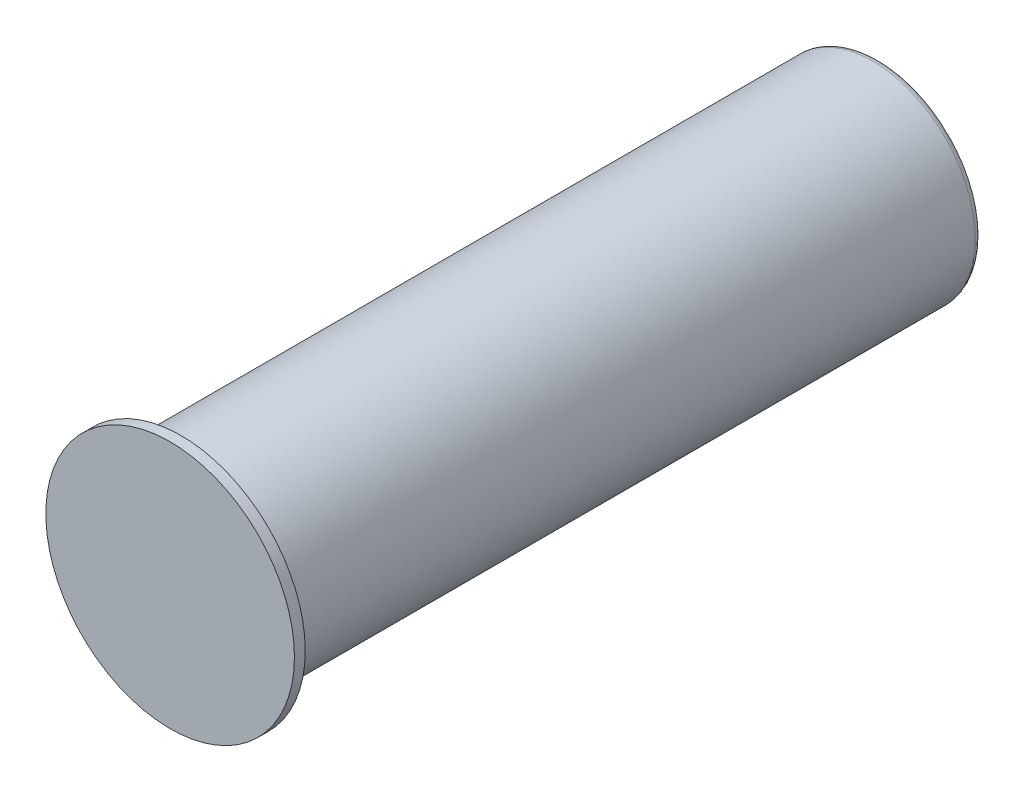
from build123d import *


with BuildPart() as part:
    # Sketch1 → Revolve1 (revolve)
    with BuildSketch(Plane(origin=(0, 0, 0), x_dir=(0, 0, -1), z_dir=(1, 0, 0)), mode=Mode.PRIVATE) as revolve1_sk:
        with BuildLine():
            Line((0, 0), (0, 57.5))
            Line((0, 57.5), (5, 57.5))
            Line((5, 57.5), (5, 47.5))
            Line((5, 47.5), (325, 47.5))
            ThreePointArc((325, 47.5), (327.121320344, 46.621320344), (328, 44.5))
            Line((328, 44.5), (328, 9.5))
            Line((328, 9.5), (326.5, 8))
            Line((326.5, 8), (312, 8))
            Line((312, 8), (307.381197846, 0))
            Line((307.381197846, 0), (0, 0))
        make_face()
    revolve(revolve1_sk.sketch.rotate(Axis((0, 0, 0), (0, 0, -1)), 90), axis=Axis((0, 0, 0), (0, 0, -1)))


solid = part.part
